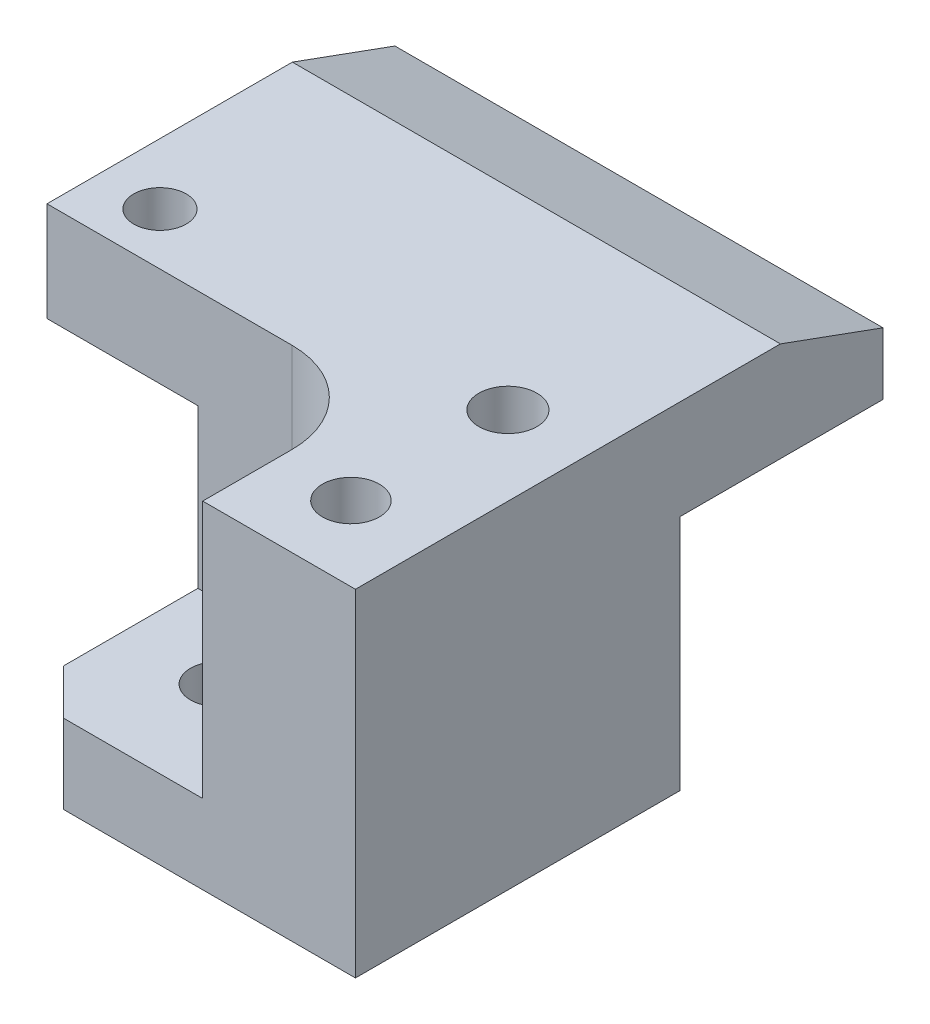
ISO-10303-21;
HEADER;
FILE_DESCRIPTION(('STEP AP214'),'2;1');
FILE_NAME('part.step','',(''),(''),'','','');
FILE_SCHEMA(('AUTOMOTIVE_DESIGN { 1 0 10303 214 1 1 1 1 }'));
ENDSEC;
DATA;
#1=APPLICATION_CONTEXT('core data for automotive mechanical design processes');
#2=APPLICATION_PROTOCOL_DEFINITION('international standard','automotive_design',2000,#1);
#3=PRODUCT_CONTEXT('',#1,'mechanical');
#4=PRODUCT('Part','Part','',(#3));
#5=PRODUCT_RELATED_PRODUCT_CATEGORY('part','',(#4));
#6=PRODUCT_DEFINITION_FORMATION('','',#4);
#7=PRODUCT_DEFINITION_CONTEXT('part definition',#1,'design');
#8=PRODUCT_DEFINITION('design','',#6,#7);
#9=PRODUCT_DEFINITION_SHAPE('','',#8);
#10=(LENGTH_UNIT() NAMED_UNIT(*) SI_UNIT(.MILLI.,.METRE.));
#11=(NAMED_UNIT(*) PLANE_ANGLE_UNIT() SI_UNIT($,.RADIAN.));
#12=(NAMED_UNIT(*) SI_UNIT($,.STERADIAN.) SOLID_ANGLE_UNIT());
#13=UNCERTAINTY_MEASURE_WITH_UNIT(LENGTH_MEASURE(1.E-05),#10,'distance_accuracy_value','');
#14=(GEOMETRIC_REPRESENTATION_CONTEXT(3) GLOBAL_UNCERTAINTY_ASSIGNED_CONTEXT((#13)) GLOBAL_UNIT_ASSIGNED_CONTEXT((#10,
#11,#12)) REPRESENTATION_CONTEXT('',''));
#15=CARTESIAN_POINT('',(0.,0.,0.));
#16=DIRECTION('',(0.,0.,1.));
#17=DIRECTION('',(1.,0.,0.));
#18=AXIS2_PLACEMENT_3D('',#15,#16,#17);
#19=CARTESIAN_POINT('',(-5.2356361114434,-4.445,7.84049905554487));
#20=DIRECTION('',(1.,0.,0.));
#21=DIRECTION('',(0.,0.,-1.));
#22=AXIS2_PLACEMENT_3D('',#19,#20,#21);
#23=PLANE('',#22);
#24=DIRECTION('',(0.,1.,0.));
#25=VECTOR('',#24,1.);
#26=CARTESIAN_POINT('',(-5.2356361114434,-4.445,11.3964990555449));
#27=LINE('',#26,#25);
#28=CARTESIAN_POINT('',(-5.2356361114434,-4.445,11.3964990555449));
#29=VERTEX_POINT('',#28);
#30=CARTESIAN_POINT('',(-5.2356361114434,8.89,11.3964990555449));
#31=VERTEX_POINT('',#30);
#32=EDGE_CURVE('E278',#29,#31,#27,.T.);
#33=ORIENTED_EDGE('',*,*,#32,.F.);
#34=DIRECTION('',(0.,0.,-1.));
#35=VECTOR('',#34,1.);
#36=CARTESIAN_POINT('',(-5.2356361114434,-4.445,7.84049905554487));
#37=LINE('',#36,#35);
#38=CARTESIAN_POINT('',(-5.2356361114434,-4.445,27.1129999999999));
#39=VERTEX_POINT('',#38);
#40=EDGE_CURVE('E211',#39,#29,#37,.T.);
#41=ORIENTED_EDGE('',*,*,#40,.F.);
#42=DIRECTION('',(0.,1.,0.));
#43=VECTOR('',#42,1.);
#44=CARTESIAN_POINT('',(-5.2356361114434,-4.445,27.1129999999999));
#45=LINE('',#44,#43);
#46=CARTESIAN_POINT('',(-5.2356361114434,0.,27.1129999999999));
#47=VERTEX_POINT('',#46);
#48=EDGE_CURVE('E184',#39,#47,#45,.T.);
#49=ORIENTED_EDGE('',*,*,#48,.T.);
#50=DIRECTION('',(0.,0.,-1.));
#51=VECTOR('',#50,1.);
#52=CARTESIAN_POINT('',(-5.2356361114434,0.,7.84049905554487));
#53=LINE('',#52,#51);
#54=CARTESIAN_POINT('',(-5.2356361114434,0.,19.558));
#55=VERTEX_POINT('',#54);
#56=EDGE_CURVE('E210',#47,#55,#53,.T.);
#57=ORIENTED_EDGE('',*,*,#56,.T.);
#58=DIRECTION('',(0.,-1.,0.));
#59=VECTOR('',#58,1.);
#60=CARTESIAN_POINT('',(-5.2356361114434,23.3543147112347,19.558));
#61=LINE('',#60,#59);
#62=CARTESIAN_POINT('',(-5.2356361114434,8.89,19.558));
#63=VERTEX_POINT('',#62);
#64=EDGE_CURVE('E253',#63,#55,#61,.T.);
#65=ORIENTED_EDGE('',*,*,#64,.F.);
#66=DIRECTION('',(0.,0.,1.));
#67=VECTOR('',#66,1.);
#68=CARTESIAN_POINT('',(-5.2356361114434,8.89,7.84049905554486));
#69=LINE('',#68,#67);
#70=EDGE_CURVE('E250',#31,#63,#69,.T.);
#71=ORIENTED_EDGE('',*,*,#70,.F.);
#72=EDGE_LOOP('',(#33,#41,#49,#57,#65,#71));
#73=FACE_BOUND('',#72,.T.);
#74=ADVANCED_FACE('F42',(#73),#23,.F.);
#75=CARTESIAN_POINT('',(5.2356361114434,-4.445,27.6467186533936));
#76=DIRECTION('',(0.,-1.,0.));
#77=DIRECTION('',(0.,0.,-1.));
#78=AXIS2_PLACEMENT_3D('',#75,#76,#77);
#79=PLANE('',#78);
#80=CARTESIAN_POINT('',(-0.00420000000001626,-4.445,23.653));
#81=DIRECTION('',(0.,-1.,0.));
#82=DIRECTION('',(0.,0.,-1.));
#83=AXIS2_PLACEMENT_3D('',#80,#81,#82);
#84=CIRCLE('',#83,1.55);
#85=CARTESIAN_POINT('',(-0.00420000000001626,-4.445,22.103));
#86=VERTEX_POINT('',#85);
#87=EDGE_CURVE('E171',#86,#86,#84,.T.);
#88=ORIENTED_EDGE('',*,*,#87,.F.);
#89=EDGE_LOOP('',(#88));
#90=FACE_BOUND('',#89,.T.);
#91=CARTESIAN_POINT('',(9.271,-4.445,16.637));
#92=DIRECTION('',(0.,-1.,0.));
#93=DIRECTION('',(0.,0.,-1.));
#94=AXIS2_PLACEMENT_3D('',#91,#92,#93);
#95=CIRCLE('',#94,3.37311999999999);
#96=CARTESIAN_POINT('',(9.271,-4.445,13.26388));
#97=VERTEX_POINT('',#96);
#98=EDGE_CURVE('E301',#97,#97,#95,.T.);
#99=ORIENTED_EDGE('',*,*,#98,.F.);
#100=EDGE_LOOP('',(#99));
#101=FACE_BOUND('',#100,.T.);
#102=ORIENTED_EDGE('',*,*,#40,.T.);
#103=DIRECTION('',(-1.,0.,0.));
#104=VECTOR('',#103,1.);
#105=CARTESIAN_POINT('',(-5.2356361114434,-4.445,11.3964990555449));
#106=LINE('',#105,#104);
#107=CARTESIAN_POINT('',(13.716,-4.445,11.3964990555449));
#108=VERTEX_POINT('',#107);
#109=EDGE_CURVE('E281',#108,#29,#106,.T.);
#110=ORIENTED_EDGE('',*,*,#109,.F.);
#111=DIRECTION('',(0.,0.,1.));
#112=VECTOR('',#111,1.);
#113=CARTESIAN_POINT('',(13.716,-4.445,29.653));
#114=LINE('',#113,#112);
#115=CARTESIAN_POINT('',(13.716,-4.445,29.653));
#116=VERTEX_POINT('',#115);
#117=EDGE_CURVE('E203',#108,#116,#114,.T.);
#118=ORIENTED_EDGE('',*,*,#117,.T.);
#119=DIRECTION('',(-1.,0.,0.));
#120=VECTOR('',#119,1.);
#121=CARTESIAN_POINT('',(5.1308,-4.445,29.653));
#122=LINE('',#121,#120);
#123=CARTESIAN_POINT('',(-2.69563611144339,-4.445,29.653));
#124=VERTEX_POINT('',#123);
#125=EDGE_CURVE('E174',#116,#124,#122,.T.);
#126=ORIENTED_EDGE('',*,*,#125,.T.);
#127=DIRECTION('',(0.70710678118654,0.,0.707106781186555));
#128=VECTOR('',#127,1.);
#129=CARTESIAN_POINT('',(0.266859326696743,-4.445,32.6154954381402));
#130=LINE('',#129,#128);
#131=EDGE_CURVE('E13',#124,#39,#130,.F.);
#132=ORIENTED_EDGE('',*,*,#131,.T.);
#133=EDGE_LOOP('',(#102,#110,#118,#126,#132));
#134=FACE_BOUND('',#133,.T.);
#135=ADVANCED_FACE('F200',(#90,#101,#134),#79,.T.);
#136=CARTESIAN_POINT('',(5.1308,14.478,39.8966030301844));
#137=DIRECTION('',(1.,0.,0.));
#138=DIRECTION('',(0.,0.,-1.));
#139=AXIS2_PLACEMENT_3D('',#136,#137,#138);
#140=PLANE('',#139);
#141=DIRECTION('',(0.,0.,-1.));
#142=VECTOR('',#141,1.);
#143=CARTESIAN_POINT('',(5.1308,14.478,39.8966030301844));
#144=LINE('',#143,#142);
#145=CARTESIAN_POINT('',(5.1308,14.478,29.653));
#146=VERTEX_POINT('',#145);
#147=CARTESIAN_POINT('',(5.1308,14.478,24.638));
#148=VERTEX_POINT('',#147);
#149=EDGE_CURVE('E267',#146,#148,#144,.T.);
#150=ORIENTED_EDGE('',*,*,#149,.T.);
#151=DIRECTION('',(0.,-1.,0.));
#152=VECTOR('',#151,1.);
#153=CARTESIAN_POINT('',(5.1308,0.,24.638));
#154=LINE('',#153,#152);
#155=CARTESIAN_POINT('',(5.1308,0.,24.638));
#156=VERTEX_POINT('',#155);
#157=EDGE_CURVE('E170',#148,#156,#154,.T.);
#158=ORIENTED_EDGE('',*,*,#157,.T.);
#159=DIRECTION('',(0.,0.,1.));
#160=VECTOR('',#159,1.);
#161=CARTESIAN_POINT('',(5.1308,0.,27.6467186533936));
#162=LINE('',#161,#160);
#163=CARTESIAN_POINT('',(5.1308,0.,29.653));
#164=VERTEX_POINT('',#163);
#165=EDGE_CURVE('E263',#156,#164,#162,.T.);
#166=ORIENTED_EDGE('',*,*,#165,.T.);
#167=DIRECTION('',(0.,1.,0.));
#168=VECTOR('',#167,1.);
#169=CARTESIAN_POINT('',(5.1308,14.478,29.653));
#170=LINE('',#169,#168);
#171=EDGE_CURVE('E268',#164,#146,#170,.T.);
#172=ORIENTED_EDGE('',*,*,#171,.T.);
#173=EDGE_LOOP('',(#150,#158,#166,#172));
#174=FACE_BOUND('',#173,.T.);
#175=ADVANCED_FACE('F273',(#174),#140,.F.);
#176=CARTESIAN_POINT('',(13.716,14.478,19.558));
#177=DIRECTION('',(0.,0.,-1.));
#178=DIRECTION('',(-1.,0.,0.));
#179=AXIS2_PLACEMENT_3D('',#176,#177,#178);
#180=PLANE('',#179);
#181=DIRECTION('',(-1.,0.,0.));
#182=VECTOR('',#181,1.);
#183=CARTESIAN_POINT('',(13.716,0.,19.558));
#184=LINE('',#183,#182);
#185=CARTESIAN_POINT('',(0.0508000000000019,0.,19.558));
#186=VERTEX_POINT('',#185);
#187=EDGE_CURVE('E162',#186,#55,#184,.T.);
#188=ORIENTED_EDGE('',*,*,#187,.F.);
#189=DIRECTION('',(0.,-1.,0.));
#190=VECTOR('',#189,1.);
#191=CARTESIAN_POINT('',(0.050800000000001,14.478,19.558));
#192=LINE('',#191,#190);
#193=CARTESIAN_POINT('',(0.0508000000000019,14.478,19.558));
#194=VERTEX_POINT('',#193);
#195=EDGE_CURVE('E180',#186,#194,#192,.F.);
#196=ORIENTED_EDGE('',*,*,#195,.T.);
#197=DIRECTION('',(-1.,0.,0.));
#198=VECTOR('',#197,1.);
#199=CARTESIAN_POINT('',(13.716,14.478,19.558));
#200=LINE('',#199,#198);
#201=CARTESIAN_POINT('',(-13.716,14.478,19.558));
#202=VERTEX_POINT('',#201);
#203=EDGE_CURVE('E159',#194,#202,#200,.T.);
#204=ORIENTED_EDGE('',*,*,#203,.T.);
#205=DIRECTION('',(0.,-1.,0.));
#206=VECTOR('',#205,1.);
#207=CARTESIAN_POINT('',(-13.716,14.478,19.558));
#208=LINE('',#207,#206);
#209=CARTESIAN_POINT('',(-13.716,8.89,19.558));
#210=VERTEX_POINT('',#209);
#211=EDGE_CURVE('E228',#202,#210,#208,.T.);
#212=ORIENTED_EDGE('',*,*,#211,.T.);
#213=DIRECTION('',(-1.,0.,0.));
#214=VECTOR('',#213,1.);
#215=CARTESIAN_POINT('',(-5.2356361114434,8.89,19.558));
#216=LINE('',#215,#214);
#217=EDGE_CURVE('E246',#63,#210,#216,.T.);
#218=ORIENTED_EDGE('',*,*,#217,.F.);
#219=ORIENTED_EDGE('',*,*,#64,.T.);
#220=EDGE_LOOP('',(#188,#196,#204,#212,#218,#219));
#221=FACE_BOUND('',#220,.T.);
#222=ADVANCED_FACE('F238',(#221),#180,.F.);
#223=CARTESIAN_POINT('',(5.2356361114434,0.,27.6467186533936));
#224=DIRECTION('',(0.,-1.,0.));
#225=DIRECTION('',(0.,0.,-1.));
#226=AXIS2_PLACEMENT_3D('',#223,#224,#225);
#227=PLANE('',#226);
#228=CARTESIAN_POINT('',(-0.00420000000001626,0.,23.653));
#229=DIRECTION('',(0.,1.,0.));
#230=DIRECTION('',(0.,0.,1.));
#231=AXIS2_PLACEMENT_3D('',#228,#229,#230);
#232=CIRCLE('',#231,1.55);
#233=CARTESIAN_POINT('',(-0.00420000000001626,0.,25.203));
#234=VERTEX_POINT('',#233);
#235=EDGE_CURVE('E175',#234,#234,#232,.T.);
#236=ORIENTED_EDGE('',*,*,#235,.F.);
#237=EDGE_LOOP('',(#236));
#238=FACE_BOUND('',#237,.T.);
#239=ORIENTED_EDGE('',*,*,#56,.F.);
#240=DIRECTION('',(-0.70710678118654,0.,-0.707106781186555));
#241=VECTOR('',#240,1.);
#242=CARTESIAN_POINT('',(-5.2356361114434,0.,27.1129999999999));
#243=LINE('',#242,#241);
#244=CARTESIAN_POINT('',(-2.69563611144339,0.,29.653));
#245=VERTEX_POINT('',#244);
#246=EDGE_CURVE('E187',#47,#245,#243,.F.);
#247=ORIENTED_EDGE('',*,*,#246,.T.);
#248=DIRECTION('',(1.,0.,0.));
#249=VECTOR('',#248,1.);
#250=CARTESIAN_POINT('',(5.13080000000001,0.,29.653));
#251=LINE('',#250,#249);
#252=EDGE_CURVE('E195',#245,#164,#251,.T.);
#253=ORIENTED_EDGE('',*,*,#252,.T.);
#254=ORIENTED_EDGE('',*,*,#165,.F.);
#255=CARTESIAN_POINT('',(0.050800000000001,0.,24.638));
#256=DIRECTION('',(0.,-1.,0.));
#257=DIRECTION('',(0.,0.,-1.));
#258=AXIS2_PLACEMENT_3D('',#255,#256,#257);
#259=CIRCLE('',#258,5.08);
#260=EDGE_CURVE('E178',#156,#186,#259,.F.);
#261=ORIENTED_EDGE('',*,*,#260,.T.);
#262=ORIENTED_EDGE('',*,*,#187,.T.);
#263=EDGE_LOOP('',(#239,#247,#253,#254,#261,#262));
#264=FACE_BOUND('',#263,.T.);
#265=ADVANCED_FACE('F213',(#238,#264),#227,.F.);
#266=CARTESIAN_POINT('',(13.716,0.,0.));
#267=DIRECTION('',(0.,0.,1.));
#268=DIRECTION('',(1.,0.,0.));
#269=AXIS2_PLACEMENT_3D('',#266,#267,#268);
#270=PLANE('',#269);
#271=DIRECTION('',(0.,1.,0.));
#272=VECTOR('',#271,1.);
#273=CARTESIAN_POINT('',(-13.716,0.,0.));
#274=LINE('',#273,#272);
#275=CARTESIAN_POINT('',(-13.716,8.89,0.));
#276=VERTEX_POINT('',#275);
#277=CARTESIAN_POINT('',(-13.716,12.379420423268,0.));
#278=VERTEX_POINT('',#277);
#279=EDGE_CURVE('E231',#276,#278,#274,.T.);
#280=ORIENTED_EDGE('',*,*,#279,.T.);
#281=DIRECTION('',(1.,0.,0.));
#282=VECTOR('',#281,1.);
#283=CARTESIAN_POINT('',(-13.716,12.379420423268,0.));
#284=LINE('',#283,#282);
#285=CARTESIAN_POINT('',(13.716,12.379420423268,0.));
#286=VERTEX_POINT('',#285);
#287=EDGE_CURVE('E57',#278,#286,#284,.T.);
#288=ORIENTED_EDGE('',*,*,#287,.T.);
#289=DIRECTION('',(0.,1.,0.));
#290=VECTOR('',#289,1.);
#291=CARTESIAN_POINT('',(13.716,0.,0.));
#292=LINE('',#291,#290);
#293=CARTESIAN_POINT('',(13.716,8.89,0.));
#294=VERTEX_POINT('',#293);
#295=EDGE_CURVE('E152',#294,#286,#292,.T.);
#296=ORIENTED_EDGE('',*,*,#295,.F.);
#297=DIRECTION('',(1.,0.,0.));
#298=VECTOR('',#297,1.);
#299=CARTESIAN_POINT('',(-13.716,8.89,0.));
#300=LINE('',#299,#298);
#301=EDGE_CURVE('E225',#276,#294,#300,.T.);
#302=ORIENTED_EDGE('',*,*,#301,.F.);
#303=EDGE_LOOP('',(#280,#288,#296,#302));
#304=FACE_BOUND('',#303,.T.);
#305=ADVANCED_FACE('F331',(#304),#270,.F.);
#306=CARTESIAN_POINT('',(13.716,14.478,0.));
#307=DIRECTION('',(0.,-1.,0.));
#308=DIRECTION('',(0.,0.,-1.));
#309=AXIS2_PLACEMENT_3D('',#306,#307,#308);
#310=PLANE('',#309);
#311=CARTESIAN_POINT('',(9.271,14.478,25.462));
#312=DIRECTION('',(0.,1.,0.));
#313=DIRECTION('',(0.,0.,1.));
#314=AXIS2_PLACEMENT_3D('',#311,#312,#313);
#315=CIRCLE('',#314,1.6002);
#316=CARTESIAN_POINT('',(9.271,14.478,27.0622));
#317=VERTEX_POINT('',#316);
#318=EDGE_CURVE('E289',#317,#317,#315,.T.);
#319=ORIENTED_EDGE('',*,*,#318,.F.);
#320=EDGE_LOOP('',(#319));
#321=FACE_BOUND('',#320,.T.);
#322=CARTESIAN_POINT('',(9.271,14.478,16.637));
#323=DIRECTION('',(0.,-1.,0.));
#324=DIRECTION('',(0.,0.,-1.));
#325=AXIS2_PLACEMENT_3D('',#322,#323,#324);
#326=CIRCLE('',#325,1.63194999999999);
#327=CARTESIAN_POINT('',(9.271,14.478,15.00505));
#328=VERTEX_POINT('',#327);
#329=EDGE_CURVE('E292',#328,#328,#326,.T.);
#330=ORIENTED_EDGE('',*,*,#329,.T.);
#331=EDGE_LOOP('',(#330));
#332=FACE_BOUND('',#331,.T.);
#333=CARTESIAN_POINT('',(-10.287,14.478,16.637));
#334=DIRECTION('',(0.,-1.,0.));
#335=DIRECTION('',(0.,0.,-1.));
#336=AXIS2_PLACEMENT_3D('',#333,#334,#335);
#337=CIRCLE('',#336,1.4732);
#338=CARTESIAN_POINT('',(-10.287,14.478,15.1638));
#339=VERTEX_POINT('',#338);
#340=EDGE_CURVE('E256',#339,#339,#337,.T.);
#341=ORIENTED_EDGE('',*,*,#340,.T.);
#342=EDGE_LOOP('',(#341));
#343=FACE_BOUND('',#342,.T.);
#344=DIRECTION('',(0.,0.,1.));
#345=VECTOR('',#344,1.);
#346=CARTESIAN_POINT('',(13.716,14.478,0.));
#347=LINE('',#346,#345);
#348=CARTESIAN_POINT('',(13.716,14.478,5.7658));
#349=VERTEX_POINT('',#348);
#350=CARTESIAN_POINT('',(13.716,14.478,29.653));
#351=VERTEX_POINT('',#350);
#352=EDGE_CURVE('E148',#349,#351,#347,.T.);
#353=ORIENTED_EDGE('',*,*,#352,.F.);
#354=DIRECTION('',(1.,0.,0.));
#355=VECTOR('',#354,1.);
#356=CARTESIAN_POINT('',(-13.716,14.478,5.7658));
#357=LINE('',#356,#355);
#358=CARTESIAN_POINT('',(-13.716,14.478,5.7658));
#359=VERTEX_POINT('',#358);
#360=EDGE_CURVE('E135',#359,#349,#357,.T.);
#361=ORIENTED_EDGE('',*,*,#360,.F.);
#362=DIRECTION('',(0.,0.,1.));
#363=VECTOR('',#362,1.);
#364=CARTESIAN_POINT('',(-13.716,14.478,0.));
#365=LINE('',#364,#363);
#366=EDGE_CURVE('E164',#359,#202,#365,.T.);
#367=ORIENTED_EDGE('',*,*,#366,.T.);
#368=ORIENTED_EDGE('',*,*,#203,.F.);
#369=CARTESIAN_POINT('',(0.050800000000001,14.478,24.638));
#370=DIRECTION('',(0.,-1.,0.));
#371=DIRECTION('',(0.,0.,-1.));
#372=AXIS2_PLACEMENT_3D('',#369,#370,#371);
#373=CIRCLE('',#372,5.08);
#374=EDGE_CURVE('E182',#194,#148,#373,.T.);
#375=ORIENTED_EDGE('',*,*,#374,.T.);
#376=ORIENTED_EDGE('',*,*,#149,.F.);
#377=DIRECTION('',(1.,0.,0.));
#378=VECTOR('',#377,1.);
#379=CARTESIAN_POINT('',(13.716,14.478,29.653));
#380=LINE('',#379,#378);
#381=EDGE_CURVE('E158',#146,#351,#380,.T.);
#382=ORIENTED_EDGE('',*,*,#381,.T.);
#383=EDGE_LOOP('',(#353,#361,#367,#368,#375,#376,#382));
#384=FACE_BOUND('',#383,.T.);
#385=ADVANCED_FACE('F155',(#321,#332,#343,#384),#310,.F.);
#386=CARTESIAN_POINT('',(13.716,0.,19.558));
#387=DIRECTION('',(1.,0.,0.));
#388=DIRECTION('',(0.,0.,-1.));
#389=AXIS2_PLACEMENT_3D('',#386,#387,#388);
#390=PLANE('',#389);
#391=DIRECTION('',(0.,-0.342020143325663,-0.939692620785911));
#392=VECTOR('',#391,1.);
#393=CARTESIAN_POINT('',(13.716,14.478,5.7658));
#394=LINE('',#393,#392);
#395=EDGE_CURVE('E138',#349,#286,#394,.T.);
#396=ORIENTED_EDGE('',*,*,#395,.F.);
#397=ORIENTED_EDGE('',*,*,#352,.T.);
#398=DIRECTION('',(0.,-1.,0.));
#399=VECTOR('',#398,1.);
#400=CARTESIAN_POINT('',(13.716,14.478,29.653));
#401=LINE('',#400,#399);
#402=EDGE_CURVE('E216',#351,#116,#401,.T.);
#403=ORIENTED_EDGE('',*,*,#402,.T.);
#404=ORIENTED_EDGE('',*,*,#117,.F.);
#405=DIRECTION('',(0.,-1.,0.));
#406=VECTOR('',#405,1.);
#407=CARTESIAN_POINT('',(13.716,-4.445,11.3964990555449));
#408=LINE('',#407,#406);
#409=CARTESIAN_POINT('',(13.716,8.89,11.3964990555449));
#410=VERTEX_POINT('',#409);
#411=EDGE_CURVE('E65',#410,#108,#408,.T.);
#412=ORIENTED_EDGE('',*,*,#411,.F.);
#413=DIRECTION('',(0.,0.,1.));
#414=VECTOR('',#413,1.);
#415=CARTESIAN_POINT('',(13.716,8.89,0.));
#416=LINE('',#415,#414);
#417=EDGE_CURVE('E218',#294,#410,#416,.T.);
#418=ORIENTED_EDGE('',*,*,#417,.F.);
#419=ORIENTED_EDGE('',*,*,#295,.T.);
#420=EDGE_LOOP('',(#396,#397,#403,#404,#412,#418,#419));
#421=FACE_BOUND('',#420,.T.);
#422=ADVANCED_FACE('F146',(#421),#390,.T.);
#423=CARTESIAN_POINT('',(-13.716,0.,19.558));
#424=DIRECTION('',(1.,0.,0.));
#425=DIRECTION('',(0.,0.,-1.));
#426=AXIS2_PLACEMENT_3D('',#423,#424,#425);
#427=PLANE('',#426);
#428=ORIENTED_EDGE('',*,*,#366,.F.);
#429=DIRECTION('',(0.,-0.342020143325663,-0.939692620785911));
#430=VECTOR('',#429,1.);
#431=CARTESIAN_POINT('',(-13.716,14.478,5.7658));
#432=LINE('',#431,#430);
#433=EDGE_CURVE('E139',#359,#278,#432,.T.);
#434=ORIENTED_EDGE('',*,*,#433,.T.);
#435=ORIENTED_EDGE('',*,*,#279,.F.);
#436=DIRECTION('',(0.,0.,1.));
#437=VECTOR('',#436,1.);
#438=CARTESIAN_POINT('',(-13.716,8.89,0.));
#439=LINE('',#438,#437);
#440=EDGE_CURVE('E223',#276,#210,#439,.T.);
#441=ORIENTED_EDGE('',*,*,#440,.T.);
#442=ORIENTED_EDGE('',*,*,#211,.F.);
#443=EDGE_LOOP('',(#428,#434,#435,#441,#442));
#444=FACE_BOUND('',#443,.T.);
#445=ADVANCED_FACE('F241',(#444),#427,.F.);
#446=CARTESIAN_POINT('',(-13.716,8.89,0.));
#447=DIRECTION('',(0.,1.,0.));
#448=DIRECTION('',(0.,0.,1.));
#449=AXIS2_PLACEMENT_3D('',#446,#447,#448);
#450=PLANE('',#449);
#451=ORIENTED_EDGE('',*,*,#417,.T.);
#452=DIRECTION('',(1.,0.,0.));
#453=VECTOR('',#452,1.);
#454=CARTESIAN_POINT('',(-5.2356361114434,8.89,11.3964990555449));
#455=LINE('',#454,#453);
#456=EDGE_CURVE('E279',#31,#410,#455,.T.);
#457=ORIENTED_EDGE('',*,*,#456,.F.);
#458=ORIENTED_EDGE('',*,*,#70,.T.);
#459=ORIENTED_EDGE('',*,*,#217,.T.);
#460=ORIENTED_EDGE('',*,*,#440,.F.);
#461=ORIENTED_EDGE('',*,*,#301,.T.);
#462=EDGE_LOOP('',(#451,#457,#458,#459,#460,#461));
#463=FACE_BOUND('',#462,.T.);
#464=CARTESIAN_POINT('',(-10.287,8.89,16.637));
#465=DIRECTION('',(0.,-1.,0.));
#466=DIRECTION('',(0.,0.,-1.));
#467=AXIS2_PLACEMENT_3D('',#464,#465,#466);
#468=CIRCLE('',#467,1.4732);
#469=CARTESIAN_POINT('',(-10.287,8.89,15.1638));
#470=VERTEX_POINT('',#469);
#471=EDGE_CURVE('E251',#470,#470,#468,.T.);
#472=ORIENTED_EDGE('',*,*,#471,.F.);
#473=EDGE_LOOP('',(#472));
#474=FACE_BOUND('',#473,.T.);
#475=ADVANCED_FACE('F247',(#463,#474),#450,.F.);
#476=CARTESIAN_POINT('',(5.1308,34.4169999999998,29.653));
#477=DIRECTION('',(0.,0.,-1.00000000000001));
#478=DIRECTION('',(0.,1.00000000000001,0.));
#479=AXIS2_PLACEMENT_3D('',#476,#477,#478);
#480=PLANE('',#479);
#481=ORIENTED_EDGE('',*,*,#252,.F.);
#482=DIRECTION('',(0.,-1.,0.));
#483=VECTOR('',#482,1.);
#484=CARTESIAN_POINT('',(-2.69563611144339,34.4169999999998,29.653));
#485=LINE('',#484,#483);
#486=EDGE_CURVE('E50',#245,#124,#485,.T.);
#487=ORIENTED_EDGE('',*,*,#486,.T.);
#488=ORIENTED_EDGE('',*,*,#125,.F.);
#489=ORIENTED_EDGE('',*,*,#402,.F.);
#490=ORIENTED_EDGE('',*,*,#381,.F.);
#491=ORIENTED_EDGE('',*,*,#171,.F.);
#492=EDGE_LOOP('',(#481,#487,#488,#489,#490,#491));
#493=FACE_BOUND('',#492,.T.);
#494=ADVANCED_FACE('F193',(#493),#480,.F.);
#495=CARTESIAN_POINT('',(-0.00420000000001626,0.,23.653));
#496=DIRECTION('',(0.,1.,0.));
#497=DIRECTION('',(0.,0.,1.));
#498=AXIS2_PLACEMENT_3D('',#495,#496,#497);
#499=CYLINDRICAL_SURFACE('',#498,1.55);
#500=ORIENTED_EDGE('',*,*,#87,.T.);
#501=EDGE_LOOP('',(#500));
#502=FACE_BOUND('',#501,.T.);
#503=ORIENTED_EDGE('',*,*,#235,.T.);
#504=EDGE_LOOP('',(#503));
#505=FACE_BOUND('',#504,.T.);
#506=ADVANCED_FACE('F311',(#502,#505),#499,.F.);
#507=CARTESIAN_POINT('',(-10.287,8.89,16.637));
#508=DIRECTION('',(0.,-1.,0.));
#509=DIRECTION('',(0.,0.,-1.));
#510=AXIS2_PLACEMENT_3D('',#507,#508,#509);
#511=CYLINDRICAL_SURFACE('',#510,1.4732);
#512=ORIENTED_EDGE('',*,*,#340,.F.);
#513=EDGE_LOOP('',(#512));
#514=FACE_BOUND('',#513,.T.);
#515=ORIENTED_EDGE('',*,*,#471,.T.);
#516=EDGE_LOOP('',(#515));
#517=FACE_BOUND('',#516,.T.);
#518=ADVANCED_FACE('F308',(#514,#517),#511,.F.);
#519=CARTESIAN_POINT('',(0.050800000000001,14.478,24.638));
#520=DIRECTION('',(0.,1.,0.));
#521=DIRECTION('',(0.,0.,1.));
#522=AXIS2_PLACEMENT_3D('',#519,#520,#521);
#523=CYLINDRICAL_SURFACE('',#522,5.08);
#524=ORIENTED_EDGE('',*,*,#374,.F.);
#525=ORIENTED_EDGE('',*,*,#195,.F.);
#526=ORIENTED_EDGE('',*,*,#260,.F.);
#527=ORIENTED_EDGE('',*,*,#157,.F.);
#528=EDGE_LOOP('',(#524,#525,#526,#527));
#529=FACE_BOUND('',#528,.T.);
#530=ADVANCED_FACE('F276',(#529),#523,.F.);
#531=CARTESIAN_POINT('',(9.271,-4.445,16.637));
#532=DIRECTION('',(0.,-1.,0.));
#533=DIRECTION('',(0.,0.,-1.));
#534=AXIS2_PLACEMENT_3D('',#531,#532,#533);
#535=CYLINDRICAL_SURFACE('',#534,3.37311999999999);
#536=CARTESIAN_POINT('',(9.271,5.715,16.637));
#537=DIRECTION('',(0.,-1.,0.));
#538=DIRECTION('',(0.,0.,-1.));
#539=AXIS2_PLACEMENT_3D('',#536,#537,#538);
#540=CIRCLE('',#539,3.37312);
#541=CARTESIAN_POINT('',(9.271,5.715,13.26388));
#542=VERTEX_POINT('',#541);
#543=EDGE_CURVE('E298',#542,#542,#540,.T.);
#544=ORIENTED_EDGE('',*,*,#543,.F.);
#545=EDGE_LOOP('',(#544));
#546=FACE_BOUND('',#545,.T.);
#547=ORIENTED_EDGE('',*,*,#98,.T.);
#548=EDGE_LOOP('',(#547));
#549=FACE_BOUND('',#548,.T.);
#550=ADVANCED_FACE('F339',(#546,#549),#535,.F.);
#551=CARTESIAN_POINT('',(10.90295,5.715,16.637));
#552=DIRECTION('',(0.,1.,0.));
#553=DIRECTION('',(0.,0.,1.));
#554=AXIS2_PLACEMENT_3D('',#551,#552,#553);
#555=PLANE('',#554);
#556=CARTESIAN_POINT('',(9.271,5.715,16.637));
#557=DIRECTION('',(0.,-1.,0.));
#558=DIRECTION('',(0.,0.,-1.));
#559=AXIS2_PLACEMENT_3D('',#556,#557,#558);
#560=CIRCLE('',#559,1.63195);
#561=CARTESIAN_POINT('',(9.271,5.715,15.00505));
#562=VERTEX_POINT('',#561);
#563=EDGE_CURVE('E295',#562,#562,#560,.T.);
#564=ORIENTED_EDGE('',*,*,#563,.F.);
#565=EDGE_LOOP('',(#564));
#566=FACE_BOUND('',#565,.T.);
#567=ORIENTED_EDGE('',*,*,#543,.T.);
#568=EDGE_LOOP('',(#567));
#569=FACE_BOUND('',#568,.T.);
#570=ADVANCED_FACE('F342',(#566,#569),#555,.F.);
#571=CARTESIAN_POINT('',(9.271,-4.445,16.637));
#572=DIRECTION('',(0.,-1.,0.));
#573=DIRECTION('',(0.,0.,-1.));
#574=AXIS2_PLACEMENT_3D('',#571,#572,#573);
#575=CYLINDRICAL_SURFACE('',#574,1.63195);
#576=ORIENTED_EDGE('',*,*,#329,.F.);
#577=EDGE_LOOP('',(#576));
#578=FACE_BOUND('',#577,.T.);
#579=ORIENTED_EDGE('',*,*,#563,.T.);
#580=EDGE_LOOP('',(#579));
#581=FACE_BOUND('',#580,.T.);
#582=ADVANCED_FACE('F346',(#578,#581),#575,.F.);
#583=CARTESIAN_POINT('',(9.271,14.478,25.462));
#584=DIRECTION('',(0.,1.,0.));
#585=DIRECTION('',(0.,0.,1.));
#586=AXIS2_PLACEMENT_3D('',#583,#584,#585);
#587=CYLINDRICAL_SURFACE('',#586,1.6002);
#588=CARTESIAN_POINT('',(9.271,9.398,25.462));
#589=DIRECTION('',(0.,1.,0.));
#590=DIRECTION('',(0.,0.,1.));
#591=AXIS2_PLACEMENT_3D('',#588,#589,#590);
#592=CIRCLE('',#591,1.6002);
#593=CARTESIAN_POINT('',(9.271,9.398,27.0622));
#594=VERTEX_POINT('',#593);
#595=EDGE_CURVE('E282',#594,#594,#592,.T.);
#596=ORIENTED_EDGE('',*,*,#595,.F.);
#597=EDGE_LOOP('',(#596));
#598=FACE_BOUND('',#597,.T.);
#599=ORIENTED_EDGE('',*,*,#318,.T.);
#600=EDGE_LOOP('',(#599));
#601=FACE_BOUND('',#600,.T.);
#602=ADVANCED_FACE('F350',(#598,#601),#587,.F.);
#603=CARTESIAN_POINT('',(9.271,9.398,25.462));
#604=DIRECTION('',(0.,-1.,0.));
#605=DIRECTION('',(0.,0.,-1.));
#606=AXIS2_PLACEMENT_3D('',#603,#604,#605);
#607=PLANE('',#606);
#608=ORIENTED_EDGE('',*,*,#595,.T.);
#609=EDGE_LOOP('',(#608));
#610=FACE_BOUND('',#609,.T.);
#611=ADVANCED_FACE('F354',(#610),#607,.F.);
#612=CARTESIAN_POINT('',(-5.2356361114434,-4.445,27.1129999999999));
#613=DIRECTION('',(0.707106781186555,0.,-0.70710678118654));
#614=DIRECTION('',(-0.70710678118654,0.,-0.707106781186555));
#615=AXIS2_PLACEMENT_3D('',#612,#613,#614);
#616=PLANE('',#615);
#617=ORIENTED_EDGE('',*,*,#131,.F.);
#618=ORIENTED_EDGE('',*,*,#486,.F.);
#619=ORIENTED_EDGE('',*,*,#246,.F.);
#620=ORIENTED_EDGE('',*,*,#48,.F.);
#621=EDGE_LOOP('',(#617,#618,#619,#620));
#622=FACE_BOUND('',#621,.T.);
#623=ADVANCED_FACE('F44',(#622),#616,.F.);
#624=CARTESIAN_POINT('',(-5.2356361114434,8.89,11.3964990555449));
#625=DIRECTION('',(0.,0.,-1.));
#626=DIRECTION('',(-1.,0.,0.));
#627=AXIS2_PLACEMENT_3D('',#624,#625,#626);
#628=PLANE('',#627);
#629=ORIENTED_EDGE('',*,*,#32,.T.);
#630=ORIENTED_EDGE('',*,*,#456,.T.);
#631=ORIENTED_EDGE('',*,*,#411,.T.);
#632=ORIENTED_EDGE('',*,*,#109,.T.);
#633=EDGE_LOOP('',(#629,#630,#631,#632));
#634=FACE_BOUND('',#633,.T.);
#635=ADVANCED_FACE('F359',(#634),#628,.T.);
#636=CARTESIAN_POINT('',(-13.716,14.478,5.7658));
#637=DIRECTION('',(0.,-0.939692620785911,0.342020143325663));
#638=DIRECTION('',(0.,-0.342020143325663,-0.939692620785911));
#639=AXIS2_PLACEMENT_3D('',#636,#637,#638);
#640=PLANE('',#639);
#641=ORIENTED_EDGE('',*,*,#287,.F.);
#642=ORIENTED_EDGE('',*,*,#433,.F.);
#643=ORIENTED_EDGE('',*,*,#360,.T.);
#644=ORIENTED_EDGE('',*,*,#395,.T.);
#645=EDGE_LOOP('',(#641,#642,#643,#644));
#646=FACE_BOUND('',#645,.T.);
#647=ADVANCED_FACE('F137',(#646),#640,.F.);
#648=CLOSED_SHELL('',(#74,#135,#175,#222,#265,#305,#385,#422,#445,#475,#494,#506,#518,#530,#550,
#570,#582,#602,#611,#623,#635,#647));
#649=MANIFOLD_SOLID_BREP('B2',#648);
#650=ADVANCED_BREP_SHAPE_REPRESENTATION('',(#18,#649),#14);
#651=SHAPE_DEFINITION_REPRESENTATION(#9,#650);
ENDSEC;
END-ISO-10303-21;
